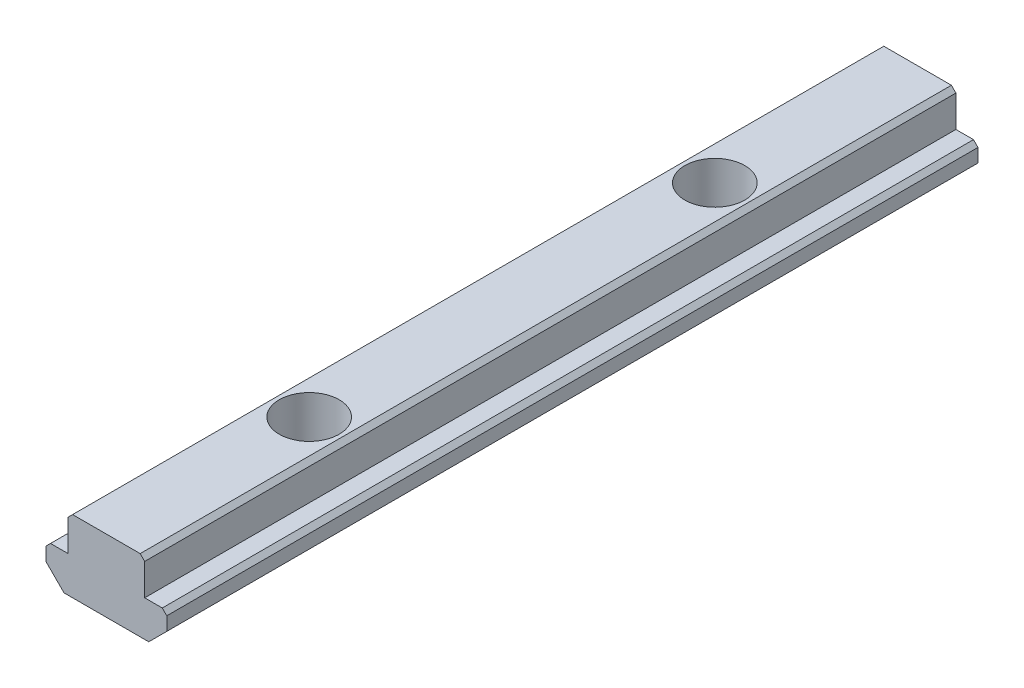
ISO-10303-21;
HEADER;
FILE_DESCRIPTION(('STEP AP214'),'2;1');
FILE_NAME('part.step','',(''),(''),'','','');
FILE_SCHEMA(('AUTOMOTIVE_DESIGN { 1 0 10303 214 1 1 1 1 }'));
ENDSEC;
DATA;
#1=APPLICATION_CONTEXT('core data for automotive mechanical design processes');
#2=APPLICATION_PROTOCOL_DEFINITION('international standard','automotive_design',2000,#1);
#3=PRODUCT_CONTEXT('',#1,'mechanical');
#4=PRODUCT('Part','Part','',(#3));
#5=PRODUCT_RELATED_PRODUCT_CATEGORY('part','',(#4));
#6=PRODUCT_DEFINITION_FORMATION('','',#4);
#7=PRODUCT_DEFINITION_CONTEXT('part definition',#1,'design');
#8=PRODUCT_DEFINITION('design','',#6,#7);
#9=PRODUCT_DEFINITION_SHAPE('','',#8);
#10=(LENGTH_UNIT() NAMED_UNIT(*) SI_UNIT(.MILLI.,.METRE.));
#11=(NAMED_UNIT(*) PLANE_ANGLE_UNIT() SI_UNIT($,.RADIAN.));
#12=(NAMED_UNIT(*) SI_UNIT($,.STERADIAN.) SOLID_ANGLE_UNIT());
#13=UNCERTAINTY_MEASURE_WITH_UNIT(LENGTH_MEASURE(1.E-05),#10,'distance_accuracy_value','');
#14=(GEOMETRIC_REPRESENTATION_CONTEXT(3) GLOBAL_UNCERTAINTY_ASSIGNED_CONTEXT((#13)) GLOBAL_UNIT_ASSIGNED_CONTEXT((#10,
#11,#12)) REPRESENTATION_CONTEXT('',''));
#15=CARTESIAN_POINT('',(0.,0.,0.));
#16=DIRECTION('',(0.,0.,1.));
#17=DIRECTION('',(1.,0.,0.));
#18=AXIS2_PLACEMENT_3D('',#15,#16,#17);
#19=CARTESIAN_POINT('',(-6.7,-0.499999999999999,0.));
#20=DIRECTION('',(-0.707106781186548,0.707106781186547,0.));
#21=DIRECTION('',(-0.707106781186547,-0.707106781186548,0.));
#22=AXIS2_PLACEMENT_3D('',#19,#20,#21);
#23=PLANE('',#22);
#24=DIRECTION('',(-0.707106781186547,-0.707106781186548,0.));
#25=VECTOR('',#24,1.);
#26=CARTESIAN_POINT('',(-6.7,-0.499999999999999,0.));
#27=LINE('',#26,#25);
#28=CARTESIAN_POINT('',(-6.2,0.,0.));
#29=VERTEX_POINT('',#28);
#30=CARTESIAN_POINT('',(-6.7,-0.499999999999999,0.));
#31=VERTEX_POINT('',#30);
#32=EDGE_CURVE('E179',#29,#31,#27,.T.);
#33=ORIENTED_EDGE('',*,*,#32,.T.);
#34=DIRECTION('',(0.,0.,1.));
#35=VECTOR('',#34,1.);
#36=CARTESIAN_POINT('',(-6.7,-0.499999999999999,0.));
#37=LINE('',#36,#35);
#38=CARTESIAN_POINT('',(-6.7,-0.499999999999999,90.));
#39=VERTEX_POINT('',#38);
#40=EDGE_CURVE('E168',#39,#31,#37,.F.);
#41=ORIENTED_EDGE('',*,*,#40,.F.);
#42=DIRECTION('',(-0.707106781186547,-0.707106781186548,0.));
#43=VECTOR('',#42,1.);
#44=CARTESIAN_POINT('',(-6.7,-0.499999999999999,90.));
#45=LINE('',#44,#43);
#46=CARTESIAN_POINT('',(-6.2,0.,90.));
#47=VERTEX_POINT('',#46);
#48=EDGE_CURVE('E182',#39,#47,#45,.F.);
#49=ORIENTED_EDGE('',*,*,#48,.T.);
#50=DIRECTION('',(0.,0.,1.));
#51=VECTOR('',#50,1.);
#52=CARTESIAN_POINT('',(-6.2,0.,0.));
#53=LINE('',#52,#51);
#54=EDGE_CURVE('E163',#29,#47,#53,.T.);
#55=ORIENTED_EDGE('',*,*,#54,.F.);
#56=EDGE_LOOP('',(#33,#41,#49,#55));
#57=FACE_BOUND('',#56,.T.);
#58=ADVANCED_FACE('F16',(#57),#23,.T.);
#59=CARTESIAN_POINT('',(6.2,0.,0.));
#60=DIRECTION('',(0.707106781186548,0.707106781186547,0.));
#61=DIRECTION('',(-0.707106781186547,0.707106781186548,0.));
#62=AXIS2_PLACEMENT_3D('',#59,#60,#61);
#63=PLANE('',#62);
#64=DIRECTION('',(-0.707106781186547,0.707106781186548,0.));
#65=VECTOR('',#64,1.);
#66=CARTESIAN_POINT('',(6.2,0.,0.));
#67=LINE('',#66,#65);
#68=CARTESIAN_POINT('',(6.7,-0.500000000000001,0.));
#69=VERTEX_POINT('',#68);
#70=CARTESIAN_POINT('',(6.2,0.,0.));
#71=VERTEX_POINT('',#70);
#72=EDGE_CURVE('E175',#69,#71,#67,.T.);
#73=ORIENTED_EDGE('',*,*,#72,.T.);
#74=DIRECTION('',(0.,0.,1.));
#75=VECTOR('',#74,1.);
#76=CARTESIAN_POINT('',(6.2,0.,0.));
#77=LINE('',#76,#75);
#78=CARTESIAN_POINT('',(6.2,0.,90.));
#79=VERTEX_POINT('',#78);
#80=EDGE_CURVE('E160',#79,#71,#77,.F.);
#81=ORIENTED_EDGE('',*,*,#80,.F.);
#82=DIRECTION('',(-0.707106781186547,0.707106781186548,0.));
#83=VECTOR('',#82,1.);
#84=CARTESIAN_POINT('',(6.2,0.,90.));
#85=LINE('',#84,#83);
#86=CARTESIAN_POINT('',(6.7,-0.500000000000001,90.));
#87=VERTEX_POINT('',#86);
#88=EDGE_CURVE('E177',#79,#87,#85,.F.);
#89=ORIENTED_EDGE('',*,*,#88,.T.);
#90=DIRECTION('',(0.,0.,-1.));
#91=VECTOR('',#90,1.);
#92=CARTESIAN_POINT('',(6.7,-0.500000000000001,0.));
#93=LINE('',#92,#91);
#94=EDGE_CURVE('E151',#69,#87,#93,.F.);
#95=ORIENTED_EDGE('',*,*,#94,.F.);
#96=EDGE_LOOP('',(#73,#81,#89,#95));
#97=FACE_BOUND('',#96,.T.);
#98=ADVANCED_FACE('F284',(#97),#63,.T.);
#99=CARTESIAN_POINT('',(3.75,4.,0.));
#100=DIRECTION('',(0.707106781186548,0.707106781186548,0.));
#101=DIRECTION('',(-0.707106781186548,0.707106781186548,0.));
#102=AXIS2_PLACEMENT_3D('',#99,#100,#101);
#103=PLANE('',#102);
#104=DIRECTION('',(-0.707106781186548,0.707106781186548,0.));
#105=VECTOR('',#104,1.);
#106=CARTESIAN_POINT('',(3.75,4.,0.));
#107=LINE('',#106,#105);
#108=CARTESIAN_POINT('',(4.25,3.5,0.));
#109=VERTEX_POINT('',#108);
#110=CARTESIAN_POINT('',(3.75,4.,0.));
#111=VERTEX_POINT('',#110);
#112=EDGE_CURVE('E127',#109,#111,#107,.T.);
#113=ORIENTED_EDGE('',*,*,#112,.T.);
#114=DIRECTION('',(0.,0.,1.));
#115=VECTOR('',#114,1.);
#116=CARTESIAN_POINT('',(3.75,4.,0.));
#117=LINE('',#116,#115);
#118=CARTESIAN_POINT('',(3.75,4.,90.));
#119=VERTEX_POINT('',#118);
#120=EDGE_CURVE('E145',#119,#111,#117,.F.);
#121=ORIENTED_EDGE('',*,*,#120,.F.);
#122=DIRECTION('',(-0.707106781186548,0.707106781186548,0.));
#123=VECTOR('',#122,1.);
#124=CARTESIAN_POINT('',(3.75,4.,90.));
#125=LINE('',#124,#123);
#126=CARTESIAN_POINT('',(4.25,3.5,90.));
#127=VERTEX_POINT('',#126);
#128=EDGE_CURVE('E173',#119,#127,#125,.F.);
#129=ORIENTED_EDGE('',*,*,#128,.T.);
#130=DIRECTION('',(0.,0.,-1.));
#131=VECTOR('',#130,1.);
#132=CARTESIAN_POINT('',(4.25,3.5,0.));
#133=LINE('',#132,#131);
#134=EDGE_CURVE('E136',#109,#127,#133,.F.);
#135=ORIENTED_EDGE('',*,*,#134,.F.);
#136=EDGE_LOOP('',(#113,#121,#129,#135));
#137=FACE_BOUND('',#136,.T.);
#138=ADVANCED_FACE('F272',(#137),#103,.T.);
#139=CARTESIAN_POINT('',(-4.24999999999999,3.5,0.));
#140=DIRECTION('',(-0.707106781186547,0.707106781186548,0.));
#141=DIRECTION('',(-0.707106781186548,-0.707106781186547,0.));
#142=AXIS2_PLACEMENT_3D('',#139,#140,#141);
#143=PLANE('',#142);
#144=DIRECTION('',(-0.707106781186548,-0.707106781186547,0.));
#145=VECTOR('',#144,1.);
#146=CARTESIAN_POINT('',(-4.24999999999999,3.5,0.));
#147=LINE('',#146,#145);
#148=CARTESIAN_POINT('',(-3.74999999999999,4.,0.));
#149=VERTEX_POINT('',#148);
#150=CARTESIAN_POINT('',(-4.24999999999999,3.5,0.));
#151=VERTEX_POINT('',#150);
#152=EDGE_CURVE('E126',#149,#151,#147,.T.);
#153=ORIENTED_EDGE('',*,*,#152,.T.);
#154=DIRECTION('',(0.,0.,1.));
#155=VECTOR('',#154,1.);
#156=CARTESIAN_POINT('',(-4.24999999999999,3.5,0.));
#157=LINE('',#156,#155);
#158=CARTESIAN_POINT('',(-4.24999999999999,3.5,90.));
#159=VERTEX_POINT('',#158);
#160=EDGE_CURVE('E130',#159,#151,#157,.F.);
#161=ORIENTED_EDGE('',*,*,#160,.F.);
#162=DIRECTION('',(-0.707106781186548,-0.707106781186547,0.));
#163=VECTOR('',#162,1.);
#164=CARTESIAN_POINT('',(-4.24999999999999,3.5,90.));
#165=LINE('',#164,#163);
#166=CARTESIAN_POINT('',(-3.74999999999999,4.,90.));
#167=VERTEX_POINT('',#166);
#168=EDGE_CURVE('E115',#159,#167,#165,.F.);
#169=ORIENTED_EDGE('',*,*,#168,.T.);
#170=DIRECTION('',(0.,0.,1.));
#171=VECTOR('',#170,1.);
#172=CARTESIAN_POINT('',(-3.74999999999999,4.,0.));
#173=LINE('',#172,#171);
#174=EDGE_CURVE('E141',#149,#167,#173,.T.);
#175=ORIENTED_EDGE('',*,*,#174,.F.);
#176=EDGE_LOOP('',(#153,#161,#169,#175));
#177=FACE_BOUND('',#176,.T.);
#178=ADVANCED_FACE('F131',(#177),#143,.T.);
#179=CARTESIAN_POINT('',(-6.7,-2.,0.));
#180=DIRECTION('',(-1.,0.,0.));
#181=DIRECTION('',(0.,0.,1.));
#182=AXIS2_PLACEMENT_3D('',#179,#180,#181);
#183=PLANE('',#182);
#184=DIRECTION('',(0.,1.,0.));
#185=VECTOR('',#184,1.);
#186=CARTESIAN_POINT('',(-6.7,-2.,0.));
#187=LINE('',#186,#185);
#188=CARTESIAN_POINT('',(-6.7,-2.,0.));
#189=VERTEX_POINT('',#188);
#190=EDGE_CURVE('E166',#31,#189,#187,.F.);
#191=ORIENTED_EDGE('',*,*,#190,.T.);
#192=DIRECTION('',(0.,0.,1.));
#193=VECTOR('',#192,1.);
#194=CARTESIAN_POINT('',(-6.7,-2.,0.));
#195=LINE('',#194,#193);
#196=CARTESIAN_POINT('',(-6.7,-2.,90.));
#197=VERTEX_POINT('',#196);
#198=EDGE_CURVE('E226',#197,#189,#195,.F.);
#199=ORIENTED_EDGE('',*,*,#198,.F.);
#200=DIRECTION('',(0.,1.,0.));
#201=VECTOR('',#200,1.);
#202=CARTESIAN_POINT('',(-6.7,-0.2830784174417,90.));
#203=LINE('',#202,#201);
#204=EDGE_CURVE('E143',#39,#197,#203,.F.);
#205=ORIENTED_EDGE('',*,*,#204,.F.);
#206=ORIENTED_EDGE('',*,*,#40,.T.);
#207=EDGE_LOOP('',(#191,#199,#205,#206));
#208=FACE_BOUND('',#207,.T.);
#209=ADVANCED_FACE('F246',(#208),#183,.T.);
#210=CARTESIAN_POINT('',(-6.2,0.,0.));
#211=DIRECTION('',(0.,1.,0.));
#212=DIRECTION('',(0.,0.,1.));
#213=AXIS2_PLACEMENT_3D('',#210,#211,#212);
#214=PLANE('',#213);
#215=DIRECTION('',(1.,0.,0.));
#216=VECTOR('',#215,1.);
#217=CARTESIAN_POINT('',(0.,0.,0.));
#218=LINE('',#217,#216);
#219=CARTESIAN_POINT('',(-4.24999999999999,0.,0.));
#220=VERTEX_POINT('',#219);
#221=EDGE_CURVE('E223',#220,#29,#218,.F.);
#222=ORIENTED_EDGE('',*,*,#221,.T.);
#223=ORIENTED_EDGE('',*,*,#54,.T.);
#224=DIRECTION('',(1.,0.,0.));
#225=VECTOR('',#224,1.);
#226=CARTESIAN_POINT('',(0.,0.,90.));
#227=LINE('',#226,#225);
#228=CARTESIAN_POINT('',(-4.24999999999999,0.,90.));
#229=VERTEX_POINT('',#228);
#230=EDGE_CURVE('E140',#229,#47,#227,.F.);
#231=ORIENTED_EDGE('',*,*,#230,.F.);
#232=DIRECTION('',(0.,0.,1.));
#233=VECTOR('',#232,1.);
#234=CARTESIAN_POINT('',(-4.24999999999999,0.,0.));
#235=LINE('',#234,#233);
#236=EDGE_CURVE('E135',#220,#229,#235,.T.);
#237=ORIENTED_EDGE('',*,*,#236,.F.);
#238=EDGE_LOOP('',(#222,#223,#231,#237));
#239=FACE_BOUND('',#238,.T.);
#240=ADVANCED_FACE('F266',(#239),#214,.T.);
#241=CARTESIAN_POINT('',(4.25,0.,0.));
#242=DIRECTION('',(0.,1.,0.));
#243=DIRECTION('',(0.,0.,1.));
#244=AXIS2_PLACEMENT_3D('',#241,#242,#243);
#245=PLANE('',#244);
#246=DIRECTION('',(1.,0.,0.));
#247=VECTOR('',#246,1.);
#248=CARTESIAN_POINT('',(0.,0.,0.));
#249=LINE('',#248,#247);
#250=CARTESIAN_POINT('',(4.25,0.,0.));
#251=VERTEX_POINT('',#250);
#252=EDGE_CURVE('E216',#71,#251,#249,.F.);
#253=ORIENTED_EDGE('',*,*,#252,.T.);
#254=DIRECTION('',(0.,0.,-1.));
#255=VECTOR('',#254,1.);
#256=CARTESIAN_POINT('',(4.25,0.,0.));
#257=LINE('',#256,#255);
#258=CARTESIAN_POINT('',(4.25,0.,90.));
#259=VERTEX_POINT('',#258);
#260=EDGE_CURVE('E157',#259,#251,#257,.T.);
#261=ORIENTED_EDGE('',*,*,#260,.F.);
#262=DIRECTION('',(1.,0.,0.));
#263=VECTOR('',#262,1.);
#264=CARTESIAN_POINT('',(0.,0.,90.));
#265=LINE('',#264,#263);
#266=EDGE_CURVE('E236',#79,#259,#265,.F.);
#267=ORIENTED_EDGE('',*,*,#266,.F.);
#268=ORIENTED_EDGE('',*,*,#80,.T.);
#269=EDGE_LOOP('',(#253,#261,#267,#268));
#270=FACE_BOUND('',#269,.T.);
#271=ADVANCED_FACE('F281',(#270),#245,.T.);
#272=CARTESIAN_POINT('',(4.25,3.5,0.));
#273=DIRECTION('',(1.,0.,0.));
#274=DIRECTION('',(0.,0.,-1.));
#275=AXIS2_PLACEMENT_3D('',#272,#273,#274);
#276=PLANE('',#275);
#277=DIRECTION('',(0.,1.,0.));
#278=VECTOR('',#277,1.);
#279=CARTESIAN_POINT('',(4.25,-0.2830784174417,0.));
#280=LINE('',#279,#278);
#281=EDGE_CURVE('E213',#251,#109,#280,.T.);
#282=ORIENTED_EDGE('',*,*,#281,.T.);
#283=ORIENTED_EDGE('',*,*,#134,.T.);
#284=DIRECTION('',(0.,1.,0.));
#285=VECTOR('',#284,1.);
#286=CARTESIAN_POINT('',(4.25,-0.2830784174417,90.));
#287=LINE('',#286,#285);
#288=EDGE_CURVE('E233',#259,#127,#287,.T.);
#289=ORIENTED_EDGE('',*,*,#288,.F.);
#290=ORIENTED_EDGE('',*,*,#260,.T.);
#291=EDGE_LOOP('',(#282,#283,#289,#290));
#292=FACE_BOUND('',#291,.T.);
#293=ADVANCED_FACE('F277',(#292),#276,.T.);
#294=CARTESIAN_POINT('',(-4.24999999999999,0.,0.));
#295=DIRECTION('',(-1.,0.,0.));
#296=DIRECTION('',(0.,0.,1.));
#297=AXIS2_PLACEMENT_3D('',#294,#295,#296);
#298=PLANE('',#297);
#299=DIRECTION('',(0.,1.,0.));
#300=VECTOR('',#299,1.);
#301=CARTESIAN_POINT('',(-4.24999999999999,-0.2830784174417,0.));
#302=LINE('',#301,#300);
#303=EDGE_CURVE('E208',#151,#220,#302,.F.);
#304=ORIENTED_EDGE('',*,*,#303,.T.);
#305=ORIENTED_EDGE('',*,*,#236,.T.);
#306=DIRECTION('',(0.,1.,0.));
#307=VECTOR('',#306,1.);
#308=CARTESIAN_POINT('',(-4.24999999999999,-0.2830784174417,90.));
#309=LINE('',#308,#307);
#310=EDGE_CURVE('E120',#159,#229,#309,.F.);
#311=ORIENTED_EDGE('',*,*,#310,.F.);
#312=ORIENTED_EDGE('',*,*,#160,.T.);
#313=EDGE_LOOP('',(#304,#305,#311,#312));
#314=FACE_BOUND('',#313,.T.);
#315=ADVANCED_FACE('F138',(#314),#298,.T.);
#316=CARTESIAN_POINT('',(6.7,-0.500000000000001,0.));
#317=DIRECTION('',(1.,0.,0.));
#318=DIRECTION('',(0.,0.,-1.));
#319=AXIS2_PLACEMENT_3D('',#316,#317,#318);
#320=PLANE('',#319);
#321=DIRECTION('',(0.,1.,0.));
#322=VECTOR('',#321,1.);
#323=CARTESIAN_POINT('',(6.7,-0.2830784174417,0.));
#324=LINE('',#323,#322);
#325=CARTESIAN_POINT('',(6.7,-2.,0.));
#326=VERTEX_POINT('',#325);
#327=EDGE_CURVE('E218',#326,#69,#324,.T.);
#328=ORIENTED_EDGE('',*,*,#327,.T.);
#329=ORIENTED_EDGE('',*,*,#94,.T.);
#330=DIRECTION('',(0.,1.,0.));
#331=VECTOR('',#330,1.);
#332=CARTESIAN_POINT('',(6.7,-0.2830784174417,90.));
#333=LINE('',#332,#331);
#334=CARTESIAN_POINT('',(6.7,-2.,90.));
#335=VERTEX_POINT('',#334);
#336=EDGE_CURVE('E239',#335,#87,#333,.T.);
#337=ORIENTED_EDGE('',*,*,#336,.F.);
#338=DIRECTION('',(0.,0.,1.));
#339=VECTOR('',#338,1.);
#340=CARTESIAN_POINT('',(6.7,-2.,0.));
#341=LINE('',#340,#339);
#342=EDGE_CURVE('E195',#326,#335,#341,.T.);
#343=ORIENTED_EDGE('',*,*,#342,.F.);
#344=EDGE_LOOP('',(#328,#329,#337,#343));
#345=FACE_BOUND('',#344,.T.);
#346=ADVANCED_FACE('F287',(#345),#320,.T.);
#347=CARTESIAN_POINT('',(-3.74999999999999,4.,0.));
#348=DIRECTION('',(0.,1.,0.));
#349=DIRECTION('',(0.,0.,1.));
#350=AXIS2_PLACEMENT_3D('',#347,#348,#349);
#351=PLANE('',#350);
#352=CARTESIAN_POINT('',(0.,4.,22.5));
#353=DIRECTION('',(0.,-1.,0.));
#354=DIRECTION('',(0.,0.,-1.));
#355=AXIS2_PLACEMENT_3D('',#352,#353,#354);
#356=CIRCLE('',#355,3.3235);
#357=CARTESIAN_POINT('',(0.,4.,19.1765));
#358=VERTEX_POINT('',#357);
#359=EDGE_CURVE('E186',#358,#358,#356,.T.);
#360=ORIENTED_EDGE('',*,*,#359,.T.);
#361=EDGE_LOOP('',(#360));
#362=FACE_BOUND('',#361,.T.);
#363=CARTESIAN_POINT('',(0.,4.,67.5));
#364=DIRECTION('',(0.,-1.,0.));
#365=DIRECTION('',(0.,0.,-1.));
#366=AXIS2_PLACEMENT_3D('',#363,#364,#365);
#367=CIRCLE('',#366,3.3235);
#368=CARTESIAN_POINT('',(0.,4.,64.1765));
#369=VERTEX_POINT('',#368);
#370=EDGE_CURVE('E20',#369,#369,#367,.T.);
#371=ORIENTED_EDGE('',*,*,#370,.T.);
#372=EDGE_LOOP('',(#371));
#373=FACE_BOUND('',#372,.T.);
#374=DIRECTION('',(1.,0.,0.));
#375=VECTOR('',#374,1.);
#376=CARTESIAN_POINT('',(0.,4.,0.));
#377=LINE('',#376,#375);
#378=EDGE_CURVE('E210',#111,#149,#377,.F.);
#379=ORIENTED_EDGE('',*,*,#378,.T.);
#380=ORIENTED_EDGE('',*,*,#174,.T.);
#381=DIRECTION('',(1.,0.,0.));
#382=VECTOR('',#381,1.);
#383=CARTESIAN_POINT('',(0.,4.,90.));
#384=LINE('',#383,#382);
#385=EDGE_CURVE('E122',#119,#167,#384,.F.);
#386=ORIENTED_EDGE('',*,*,#385,.F.);
#387=ORIENTED_EDGE('',*,*,#120,.T.);
#388=EDGE_LOOP('',(#379,#380,#386,#387));
#389=FACE_BOUND('',#388,.T.);
#390=ADVANCED_FACE('F269',(#362,#373,#389),#351,.T.);
#391=CARTESIAN_POINT('',(0.,-0.2830784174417,90.));
#392=DIRECTION('',(0.,0.,1.));
#393=DIRECTION('',(1.,0.,0.));
#394=AXIS2_PLACEMENT_3D('',#391,#392,#393);
#395=PLANE('',#394);
#396=ORIENTED_EDGE('',*,*,#128,.F.);
#397=ORIENTED_EDGE('',*,*,#385,.T.);
#398=ORIENTED_EDGE('',*,*,#168,.F.);
#399=ORIENTED_EDGE('',*,*,#310,.T.);
#400=ORIENTED_EDGE('',*,*,#230,.T.);
#401=ORIENTED_EDGE('',*,*,#48,.F.);
#402=ORIENTED_EDGE('',*,*,#204,.T.);
#403=DIRECTION('',(0.707106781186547,-0.707106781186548,0.));
#404=VECTOR('',#403,1.);
#405=CARTESIAN_POINT('',(-4.7,-4.,90.));
#406=LINE('',#405,#404);
#407=CARTESIAN_POINT('',(-4.7,-4.,90.));
#408=VERTEX_POINT('',#407);
#409=EDGE_CURVE('E229',#408,#197,#406,.F.);
#410=ORIENTED_EDGE('',*,*,#409,.F.);
#411=DIRECTION('',(1.,0.,0.));
#412=VECTOR('',#411,1.);
#413=CARTESIAN_POINT('',(4.7,-4.,90.));
#414=LINE('',#413,#412);
#415=CARTESIAN_POINT('',(4.7,-4.,90.));
#416=VERTEX_POINT('',#415);
#417=EDGE_CURVE('E188',#416,#408,#414,.F.);
#418=ORIENTED_EDGE('',*,*,#417,.F.);
#419=DIRECTION('',(0.707106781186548,0.707106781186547,0.));
#420=VECTOR('',#419,1.);
#421=CARTESIAN_POINT('',(6.7,-2.,90.));
#422=LINE('',#421,#420);
#423=EDGE_CURVE('E203',#335,#416,#422,.F.);
#424=ORIENTED_EDGE('',*,*,#423,.F.);
#425=ORIENTED_EDGE('',*,*,#336,.T.);
#426=ORIENTED_EDGE('',*,*,#88,.F.);
#427=ORIENTED_EDGE('',*,*,#266,.T.);
#428=ORIENTED_EDGE('',*,*,#288,.T.);
#429=EDGE_LOOP('',(#396,#397,#398,#399,#400,#401,#402,#410,#418,#424,#425,#426,#427,#428));
#430=FACE_BOUND('',#429,.T.);
#431=ADVANCED_FACE('F117',(#430),#395,.T.);
#432=CARTESIAN_POINT('',(-4.7,-4.,0.));
#433=DIRECTION('',(-0.707106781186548,-0.707106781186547,0.));
#434=DIRECTION('',(0.707106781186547,-0.707106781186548,0.));
#435=AXIS2_PLACEMENT_3D('',#432,#433,#434);
#436=PLANE('',#435);
#437=DIRECTION('',(0.707106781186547,-0.707106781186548,0.));
#438=VECTOR('',#437,1.);
#439=CARTESIAN_POINT('',(-6.7,-2.,0.));
#440=LINE('',#439,#438);
#441=CARTESIAN_POINT('',(-4.7,-4.,0.));
#442=VERTEX_POINT('',#441);
#443=EDGE_CURVE('E221',#189,#442,#440,.T.);
#444=ORIENTED_EDGE('',*,*,#443,.T.);
#445=DIRECTION('',(0.,0.,-1.));
#446=VECTOR('',#445,1.);
#447=CARTESIAN_POINT('',(-4.7,-4.,0.));
#448=LINE('',#447,#446);
#449=EDGE_CURVE('E192',#408,#442,#448,.T.);
#450=ORIENTED_EDGE('',*,*,#449,.F.);
#451=ORIENTED_EDGE('',*,*,#409,.T.);
#452=ORIENTED_EDGE('',*,*,#198,.T.);
#453=EDGE_LOOP('',(#444,#450,#451,#452));
#454=FACE_BOUND('',#453,.T.);
#455=ADVANCED_FACE('F250',(#454),#436,.T.);
#456=CARTESIAN_POINT('',(0.,-0.2830784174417,0.));
#457=DIRECTION('',(0.,0.,1.));
#458=DIRECTION('',(1.,0.,0.));
#459=AXIS2_PLACEMENT_3D('',#456,#457,#458);
#460=PLANE('',#459);
#461=ORIENTED_EDGE('',*,*,#152,.F.);
#462=ORIENTED_EDGE('',*,*,#378,.F.);
#463=ORIENTED_EDGE('',*,*,#112,.F.);
#464=ORIENTED_EDGE('',*,*,#281,.F.);
#465=ORIENTED_EDGE('',*,*,#252,.F.);
#466=ORIENTED_EDGE('',*,*,#72,.F.);
#467=ORIENTED_EDGE('',*,*,#327,.F.);
#468=DIRECTION('',(0.707106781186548,0.707106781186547,0.));
#469=VECTOR('',#468,1.);
#470=CARTESIAN_POINT('',(6.7,-2.,0.));
#471=LINE('',#470,#469);
#472=CARTESIAN_POINT('',(4.7,-4.,0.));
#473=VERTEX_POINT('',#472);
#474=EDGE_CURVE('E35',#473,#326,#471,.T.);
#475=ORIENTED_EDGE('',*,*,#474,.F.);
#476=DIRECTION('',(1.,0.,0.));
#477=VECTOR('',#476,1.);
#478=CARTESIAN_POINT('',(4.7,-4.,0.));
#479=LINE('',#478,#477);
#480=EDGE_CURVE('E254',#442,#473,#479,.T.);
#481=ORIENTED_EDGE('',*,*,#480,.F.);
#482=ORIENTED_EDGE('',*,*,#443,.F.);
#483=ORIENTED_EDGE('',*,*,#190,.F.);
#484=ORIENTED_EDGE('',*,*,#32,.F.);
#485=ORIENTED_EDGE('',*,*,#221,.F.);
#486=ORIENTED_EDGE('',*,*,#303,.F.);
#487=EDGE_LOOP('',(#461,#462,#463,#464,#465,#466,#467,#475,#481,#482,#483,#484,#485,#486));
#488=FACE_BOUND('',#487,.T.);
#489=ADVANCED_FACE('F261',(#488),#460,.F.);
#490=CARTESIAN_POINT('',(6.7,-2.,0.));
#491=DIRECTION('',(0.707106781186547,-0.707106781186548,0.));
#492=DIRECTION('',(0.707106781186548,0.707106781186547,0.));
#493=AXIS2_PLACEMENT_3D('',#490,#491,#492);
#494=PLANE('',#493);
#495=ORIENTED_EDGE('',*,*,#474,.T.);
#496=ORIENTED_EDGE('',*,*,#342,.T.);
#497=ORIENTED_EDGE('',*,*,#423,.T.);
#498=DIRECTION('',(0.,0.,-1.));
#499=VECTOR('',#498,1.);
#500=CARTESIAN_POINT('',(4.7,-4.,0.));
#501=LINE('',#500,#499);
#502=EDGE_CURVE('E185',#473,#416,#501,.F.);
#503=ORIENTED_EDGE('',*,*,#502,.F.);
#504=EDGE_LOOP('',(#495,#496,#497,#503));
#505=FACE_BOUND('',#504,.T.);
#506=ADVANCED_FACE('F258',(#505),#494,.T.);
#507=CARTESIAN_POINT('',(0.,4.,67.5));
#508=DIRECTION('',(0.,-1.,0.));
#509=DIRECTION('',(0.,0.,-1.));
#510=AXIS2_PLACEMENT_3D('',#507,#508,#509);
#511=CYLINDRICAL_SURFACE('',#510,3.3235);
#512=ORIENTED_EDGE('',*,*,#370,.F.);
#513=EDGE_LOOP('',(#512));
#514=FACE_BOUND('',#513,.T.);
#515=CARTESIAN_POINT('',(0.,-4.,67.5));
#516=DIRECTION('',(0.,-1.,0.));
#517=DIRECTION('',(0.,0.,-1.));
#518=AXIS2_PLACEMENT_3D('',#515,#516,#517);
#519=CIRCLE('',#518,3.3235);
#520=CARTESIAN_POINT('',(0.,-4.,64.1765));
#521=VERTEX_POINT('',#520);
#522=EDGE_CURVE('E26',#521,#521,#519,.F.);
#523=ORIENTED_EDGE('',*,*,#522,.F.);
#524=EDGE_LOOP('',(#523));
#525=FACE_BOUND('',#524,.T.);
#526=ADVANCED_FACE('F303',(#514,#525),#511,.F.);
#527=CARTESIAN_POINT('',(0.,4.,22.5));
#528=DIRECTION('',(0.,-1.,0.));
#529=DIRECTION('',(0.,0.,-1.));
#530=AXIS2_PLACEMENT_3D('',#527,#528,#529);
#531=CYLINDRICAL_SURFACE('',#530,3.3235);
#532=ORIENTED_EDGE('',*,*,#359,.F.);
#533=EDGE_LOOP('',(#532));
#534=FACE_BOUND('',#533,.T.);
#535=CARTESIAN_POINT('',(0.,-4.,22.5));
#536=DIRECTION('',(0.,-1.,0.));
#537=DIRECTION('',(0.,0.,-1.));
#538=AXIS2_PLACEMENT_3D('',#535,#536,#537);
#539=CIRCLE('',#538,3.3235);
#540=CARTESIAN_POINT('',(0.,-4.,19.1765));
#541=VERTEX_POINT('',#540);
#542=EDGE_CURVE('E11',#541,#541,#539,.F.);
#543=ORIENTED_EDGE('',*,*,#542,.F.);
#544=EDGE_LOOP('',(#543));
#545=FACE_BOUND('',#544,.T.);
#546=ADVANCED_FACE('F18',(#534,#545),#531,.F.);
#547=CARTESIAN_POINT('',(4.7,-4.,0.));
#548=DIRECTION('',(0.,-1.,0.));
#549=DIRECTION('',(0.,0.,-1.));
#550=AXIS2_PLACEMENT_3D('',#547,#548,#549);
#551=PLANE('',#550);
#552=ORIENTED_EDGE('',*,*,#542,.T.);
#553=EDGE_LOOP('',(#552));
#554=FACE_BOUND('',#553,.T.);
#555=ORIENTED_EDGE('',*,*,#522,.T.);
#556=EDGE_LOOP('',(#555));
#557=FACE_BOUND('',#556,.T.);
#558=ORIENTED_EDGE('',*,*,#480,.T.);
#559=ORIENTED_EDGE('',*,*,#502,.T.);
#560=ORIENTED_EDGE('',*,*,#417,.T.);
#561=ORIENTED_EDGE('',*,*,#449,.T.);
#562=EDGE_LOOP('',(#558,#559,#560,#561));
#563=FACE_BOUND('',#562,.T.);
#564=ADVANCED_FACE('F256',(#554,#557,#563),#551,.T.);
#565=CLOSED_SHELL('',(#58,#98,#138,#178,#209,#240,#271,#293,#315,#346,#390,#431,#455,#489,#506,
#526,#546,#564));
#566=MANIFOLD_SOLID_BREP('B1',#565);
#567=ADVANCED_BREP_SHAPE_REPRESENTATION('',(#18,#566),#14);
#568=SHAPE_DEFINITION_REPRESENTATION(#9,#567);
ENDSEC;
END-ISO-10303-21;
